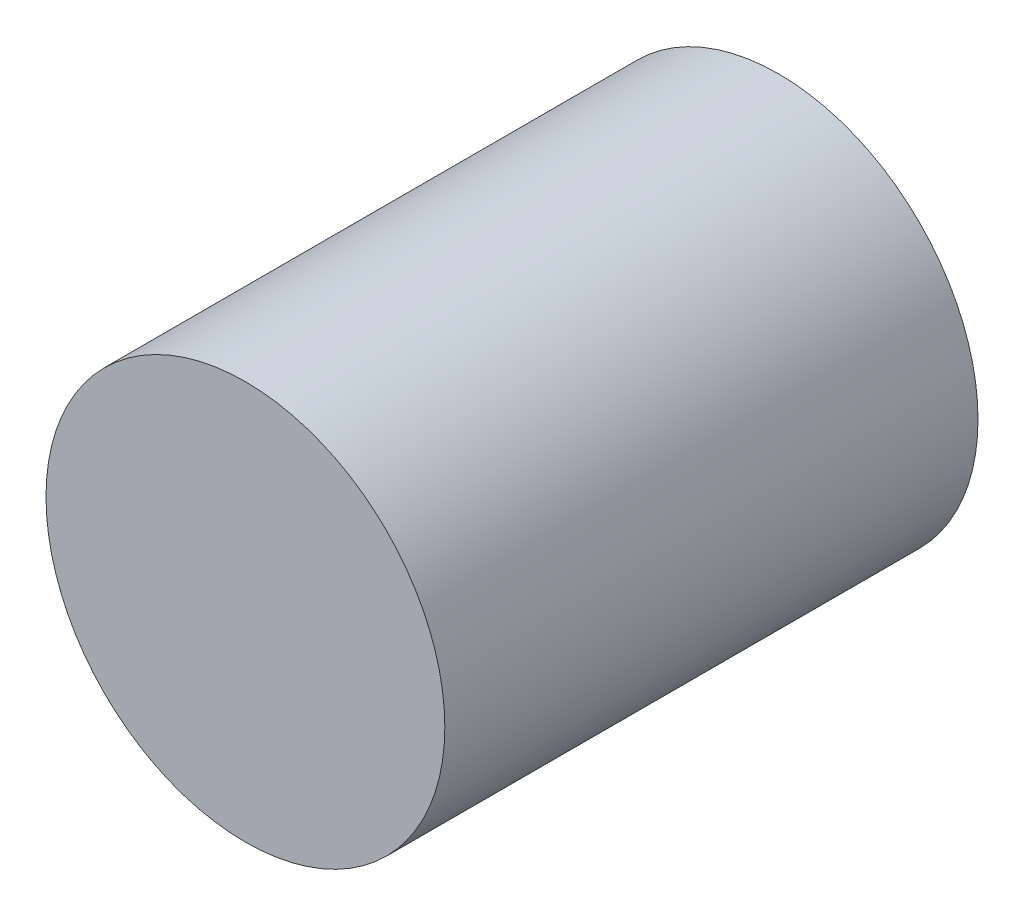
from build123d import *

# Parameters (mm, degrees)
SKIZZE1_R               = 4.75
LINEAR_AUSTRAGEN1_DEPTH = 12.7


with BuildPart() as part:
    # Skizze1 → Linear austragen1 (new body)
    with BuildSketch(Plane.XY):
        Circle(SKIZZE1_R)
    extrude(amount=LINEAR_AUSTRAGEN1_DEPTH)


solid = part.part
